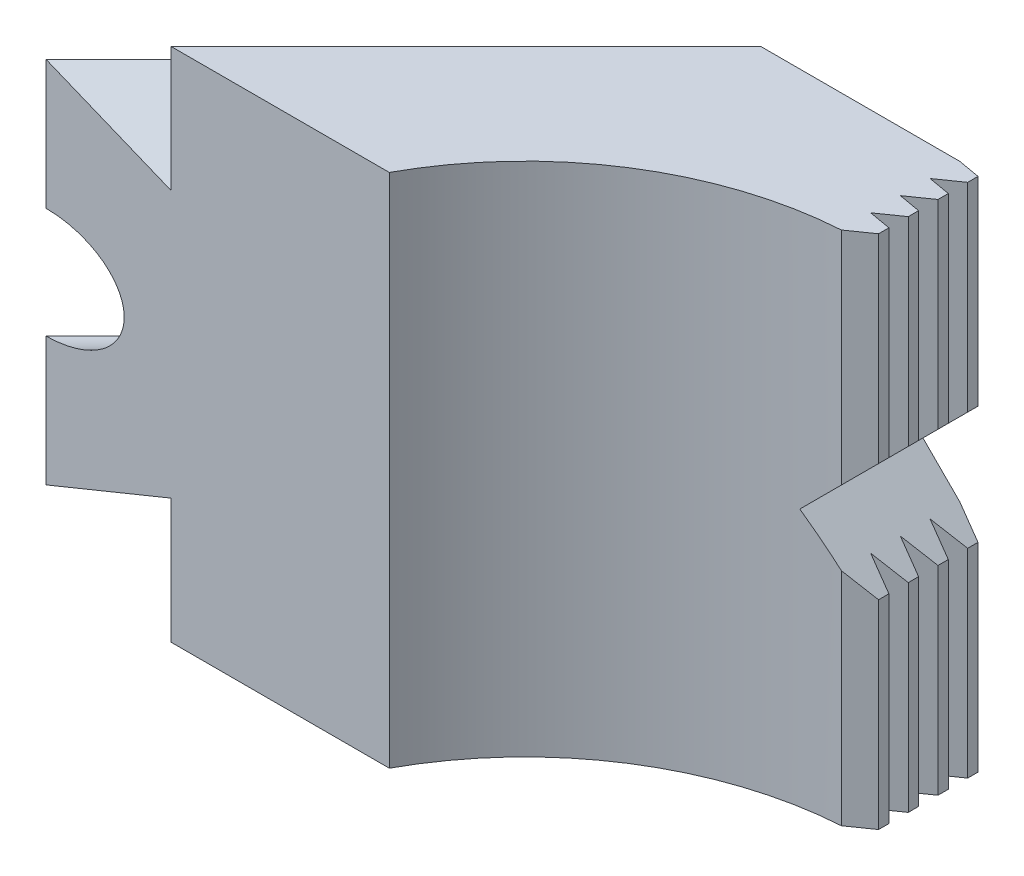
ISO-10303-21;
HEADER;
FILE_DESCRIPTION(('STEP AP214'),'2;1');
FILE_NAME('part.step','',(''),(''),'','','');
FILE_SCHEMA(('AUTOMOTIVE_DESIGN { 1 0 10303 214 1 1 1 1 }'));
ENDSEC;
DATA;
#1=APPLICATION_CONTEXT('core data for automotive mechanical design processes');
#2=APPLICATION_PROTOCOL_DEFINITION('international standard','automotive_design',2000,#1);
#3=PRODUCT_CONTEXT('',#1,'mechanical');
#4=PRODUCT('Part','Part','',(#3));
#5=PRODUCT_RELATED_PRODUCT_CATEGORY('part','',(#4));
#6=PRODUCT_DEFINITION_FORMATION('','',#4);
#7=PRODUCT_DEFINITION_CONTEXT('part definition',#1,'design');
#8=PRODUCT_DEFINITION('design','',#6,#7);
#9=PRODUCT_DEFINITION_SHAPE('','',#8);
#10=(LENGTH_UNIT() NAMED_UNIT(*) SI_UNIT(.MILLI.,.METRE.));
#11=(NAMED_UNIT(*) PLANE_ANGLE_UNIT() SI_UNIT($,.RADIAN.));
#12=(NAMED_UNIT(*) SI_UNIT($,.STERADIAN.) SOLID_ANGLE_UNIT());
#13=UNCERTAINTY_MEASURE_WITH_UNIT(LENGTH_MEASURE(1.E-05),#10,'distance_accuracy_value','');
#14=(GEOMETRIC_REPRESENTATION_CONTEXT(3) GLOBAL_UNCERTAINTY_ASSIGNED_CONTEXT((#13)) GLOBAL_UNIT_ASSIGNED_CONTEXT((#10,
#11,#12)) REPRESENTATION_CONTEXT('',''));
#15=CARTESIAN_POINT('',(0.,0.,0.));
#16=DIRECTION('',(0.,0.,1.));
#17=DIRECTION('',(1.,0.,0.));
#18=AXIS2_PLACEMENT_3D('',#15,#16,#17);
#19=CARTESIAN_POINT('',(-7.34850685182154,0.630416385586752,12.1453964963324));
#20=DIRECTION('',(0.707106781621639,-4.35089394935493E-10,-0.707106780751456));
#21=DIRECTION('',(0.666666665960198,-0.33333333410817,0.666666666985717));
#22=AXIS2_PLACEMENT_3D('',#19,#20,#21);
#23=PLANE('',#22);
#24=DIRECTION('',(-0.459499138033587,0.7600796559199,-0.459499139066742));
#25=VECTOR('',#24,1.);
#26=CARTESIAN_POINT('',(-7.34850685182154,0.630416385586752,12.1453964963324));
#27=LINE('',#26,#25);
#28=CARTESIAN_POINT('',(-7.34850685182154,0.630416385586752,12.1453964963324));
#29=VERTEX_POINT('',#28);
#30=CARTESIAN_POINT('',(-8.93377887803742,3.2526911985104,10.5601244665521));
#31=VERTEX_POINT('',#30);
#32=EDGE_CURVE('E583',#29,#31,#27,.T.);
#33=ORIENTED_EDGE('',*,*,#32,.T.);
#34=DIRECTION('',(-0.695201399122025,-0.182729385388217,-0.695201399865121));
#35=VECTOR('',#34,1.);
#36=CARTESIAN_POINT('',(-8.93377887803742,3.2526911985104,10.5601244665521));
#37=LINE('',#36,#35);
#38=CARTESIAN_POINT('',(-11.3322237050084,2.62227481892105,8.16167963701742));
#39=VERTEX_POINT('',#38);
#40=EDGE_CURVE('E586',#31,#39,#37,.T.);
#41=ORIENTED_EDGE('',*,*,#40,.T.);
#42=DIRECTION('',(-0.235702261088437,-0.942809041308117,-0.235702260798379));
#43=VECTOR('',#42,1.);
#44=CARTESIAN_POINT('',(-11.3322237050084,2.62227481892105,8.16167963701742));
#45=LINE('',#44,#43);
#46=CARTESIAN_POINT('',(-12.1453965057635,-0.630416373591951,7.34850683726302));
#47=VERTEX_POINT('',#46);
#48=EDGE_CURVE('E589',#39,#47,#45,.T.);
#49=ORIENTED_EDGE('',*,*,#48,.T.);
#50=DIRECTION('',(0.459499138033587,-0.7600796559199,0.459499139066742));
#51=VECTOR('',#50,1.);
#52=CARTESIAN_POINT('',(-12.1453965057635,-0.630416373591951,7.34850683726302));
#53=LINE('',#52,#51);
#54=CARTESIAN_POINT('',(-10.5601244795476,-3.2526911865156,8.9337788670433));
#55=VERTEX_POINT('',#54);
#56=EDGE_CURVE('E592',#47,#55,#53,.T.);
#57=ORIENTED_EDGE('',*,*,#56,.T.);
#58=DIRECTION('',(0.695201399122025,0.182729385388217,0.695201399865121));
#59=VECTOR('',#58,1.);
#60=CARTESIAN_POINT('',(-10.5601244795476,-3.2526911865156,8.9337788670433));
#61=LINE('',#60,#59);
#62=CARTESIAN_POINT('',(-8.16167965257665,-2.62227480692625,11.332223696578));
#63=VERTEX_POINT('',#62);
#64=EDGE_CURVE('E595',#55,#63,#61,.T.);
#65=ORIENTED_EDGE('',*,*,#64,.T.);
#66=DIRECTION('',(0.235702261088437,0.942809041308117,0.235702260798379));
#67=VECTOR('',#66,1.);
#68=CARTESIAN_POINT('',(-8.16167965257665,-2.62227480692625,11.332223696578));
#69=LINE('',#68,#67);
#70=EDGE_CURVE('E598',#63,#29,#69,.T.);
#71=ORIENTED_EDGE('',*,*,#70,.T.);
#72=EDGE_LOOP('',(#33,#41,#49,#57,#65,#71));
#73=FACE_BOUND('',#72,.T.);
#74=ADVANCED_FACE('F14',(#73),#23,.F.);
#75=CARTESIAN_POINT('',(-8.93377887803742,3.2526911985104,10.5601244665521));
#76=DIRECTION('',(-0.12920918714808,0.983163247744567,-0.129209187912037));
#77=DIRECTION('',(-0.695201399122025,-0.182729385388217,-0.695201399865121));
#78=AXIS2_PLACEMENT_3D('',#75,#76,#77);
#79=PLANE('',#78);
#80=DIRECTION('',(-0.695201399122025,-0.182729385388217,-0.695201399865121));
#81=VECTOR('',#80,1.);
#82=CARTESIAN_POINT('',(-13.1764195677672,3.25269120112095,14.8027651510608));
#83=LINE('',#82,#81);
#84=CARTESIAN_POINT('',(-13.1764195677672,3.25269120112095,14.8027651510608));
#85=VERTEX_POINT('',#84);
#86=CARTESIAN_POINT('',(-15.5748643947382,2.6222748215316,12.4043203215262));
#87=VERTEX_POINT('',#86);
#88=EDGE_CURVE('E568',#85,#87,#83,.T.);
#89=ORIENTED_EDGE('',*,*,#88,.T.);
#90=DIRECTION('',(-0.707106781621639,4.35089394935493E-10,0.707106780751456));
#91=VECTOR('',#90,1.);
#92=CARTESIAN_POINT('',(-11.3322237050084,2.62227481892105,8.16167963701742));
#93=LINE('',#92,#91);
#94=EDGE_CURVE('E611',#39,#87,#93,.T.);
#95=ORIENTED_EDGE('',*,*,#94,.F.);
#96=ORIENTED_EDGE('',*,*,#40,.F.);
#97=DIRECTION('',(-0.707106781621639,4.35089394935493E-10,0.707106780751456));
#98=VECTOR('',#97,1.);
#99=CARTESIAN_POINT('',(-8.93377887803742,3.2526911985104,10.5601244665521));
#100=LINE('',#99,#98);
#101=EDGE_CURVE('E601',#31,#85,#100,.T.);
#102=ORIENTED_EDGE('',*,*,#101,.T.);
#103=EDGE_LOOP('',(#89,#95,#96,#102));
#104=FACE_BOUND('',#103,.T.);
#105=ADVANCED_FACE('F640',(#104),#79,.F.);
#106=CARTESIAN_POINT('',(-11.3322237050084,2.62227481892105,8.16167963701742));
#107=DIRECTION('',(-0.666666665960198,0.33333333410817,-0.666666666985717));
#108=DIRECTION('',(-0.235702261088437,-0.942809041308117,-0.235702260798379));
#109=AXIS2_PLACEMENT_3D('',#106,#107,#108);
#110=PLANE('',#109);
#111=DIRECTION('',(-0.235702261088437,-0.942809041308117,-0.235702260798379));
#112=VECTOR('',#111,1.);
#113=CARTESIAN_POINT('',(-15.5748643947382,2.6222748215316,12.4043203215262));
#114=LINE('',#113,#112);
#115=CARTESIAN_POINT('',(-16.3880371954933,-0.6304163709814,11.5911475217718));
#116=VERTEX_POINT('',#115);
#117=EDGE_CURVE('E571',#87,#116,#114,.T.);
#118=ORIENTED_EDGE('',*,*,#117,.T.);
#119=DIRECTION('',(-0.707106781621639,4.35089394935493E-10,0.707106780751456));
#120=VECTOR('',#119,1.);
#121=CARTESIAN_POINT('',(-12.1453965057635,-0.630416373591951,7.34850683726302));
#122=LINE('',#121,#120);
#123=EDGE_CURVE('E609',#47,#116,#122,.T.);
#124=ORIENTED_EDGE('',*,*,#123,.F.);
#125=ORIENTED_EDGE('',*,*,#48,.F.);
#126=ORIENTED_EDGE('',*,*,#94,.T.);
#127=EDGE_LOOP('',(#118,#124,#125,#126));
#128=FACE_BOUND('',#127,.T.);
#129=ADVANCED_FACE('F647',(#128),#110,.F.);
#130=CARTESIAN_POINT('',(-12.1453965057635,-0.630416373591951,7.34850683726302));
#131=DIRECTION('',(-0.537457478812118,-0.649829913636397,-0.53745747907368));
#132=DIRECTION('',(0.459499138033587,-0.7600796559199,0.459499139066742));
#133=AXIS2_PLACEMENT_3D('',#130,#131,#132);
#134=PLANE('',#133);
#135=DIRECTION('',(0.459499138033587,-0.7600796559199,0.459499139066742));
#136=VECTOR('',#135,1.);
#137=CARTESIAN_POINT('',(-16.3880371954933,-0.6304163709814,11.5911475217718));
#138=LINE('',#137,#136);
#139=CARTESIAN_POINT('',(-14.8027651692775,-3.25269118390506,13.176419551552));
#140=VERTEX_POINT('',#139);
#141=EDGE_CURVE('E574',#116,#140,#138,.T.);
#142=ORIENTED_EDGE('',*,*,#141,.T.);
#143=DIRECTION('',(-0.707106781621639,4.35089394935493E-10,0.707106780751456));
#144=VECTOR('',#143,1.);
#145=CARTESIAN_POINT('',(-10.5601244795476,-3.2526911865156,8.9337788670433));
#146=LINE('',#145,#144);
#147=EDGE_CURVE('E607',#55,#140,#146,.T.);
#148=ORIENTED_EDGE('',*,*,#147,.F.);
#149=ORIENTED_EDGE('',*,*,#56,.F.);
#150=ORIENTED_EDGE('',*,*,#123,.T.);
#151=EDGE_LOOP('',(#142,#148,#149,#150));
#152=FACE_BOUND('',#151,.T.);
#153=ADVANCED_FACE('F660',(#152),#134,.F.);
#154=CARTESIAN_POINT('',(-10.5601244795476,-3.2526911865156,8.9337788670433));
#155=DIRECTION('',(0.12920918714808,-0.983163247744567,0.129209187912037));
#156=DIRECTION('',(0.695201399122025,0.182729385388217,0.695201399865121));
#157=AXIS2_PLACEMENT_3D('',#154,#155,#156);
#158=PLANE('',#157);
#159=DIRECTION('',(0.695201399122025,0.182729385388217,0.695201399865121));
#160=VECTOR('',#159,1.);
#161=CARTESIAN_POINT('',(-14.8027651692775,-3.25269118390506,13.176419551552));
#162=LINE('',#161,#160);
#163=CARTESIAN_POINT('',(-12.4043203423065,-2.6222748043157,15.5748643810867));
#164=VERTEX_POINT('',#163);
#165=EDGE_CURVE('E577',#140,#164,#162,.T.);
#166=ORIENTED_EDGE('',*,*,#165,.T.);
#167=DIRECTION('',(-0.707106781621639,4.35089394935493E-10,0.707106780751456));
#168=VECTOR('',#167,1.);
#169=CARTESIAN_POINT('',(-8.16167965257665,-2.62227480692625,11.332223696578));
#170=LINE('',#169,#168);
#171=EDGE_CURVE('E605',#63,#164,#170,.T.);
#172=ORIENTED_EDGE('',*,*,#171,.F.);
#173=ORIENTED_EDGE('',*,*,#64,.F.);
#174=ORIENTED_EDGE('',*,*,#147,.T.);
#175=EDGE_LOOP('',(#166,#172,#173,#174));
#176=FACE_BOUND('',#175,.T.);
#177=ADVANCED_FACE('F656',(#176),#158,.F.);
#178=CARTESIAN_POINT('',(-8.16167965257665,-2.62227480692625,11.332223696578));
#179=DIRECTION('',(0.666666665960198,-0.33333333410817,0.666666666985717));
#180=DIRECTION('',(-0.707106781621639,4.35089394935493E-10,0.707106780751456));
#181=AXIS2_PLACEMENT_3D('',#178,#179,#180);
#182=PLANE('',#181);
#183=DIRECTION('',(0.235702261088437,0.942809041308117,0.235702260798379));
#184=VECTOR('',#183,1.);
#185=CARTESIAN_POINT('',(-12.4043203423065,-2.6222748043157,15.5748643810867));
#186=LINE('',#185,#184);
#187=CARTESIAN_POINT('',(-11.5911475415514,0.630416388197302,16.3880371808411));
#188=VERTEX_POINT('',#187);
#189=EDGE_CURVE('E580',#164,#188,#186,.T.);
#190=ORIENTED_EDGE('',*,*,#189,.T.);
#191=DIRECTION('',(-0.707106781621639,4.35089394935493E-10,0.707106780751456));
#192=VECTOR('',#191,1.);
#193=CARTESIAN_POINT('',(-7.34850685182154,0.630416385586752,12.1453964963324));
#194=LINE('',#193,#192);
#195=EDGE_CURVE('E602',#29,#188,#194,.T.);
#196=ORIENTED_EDGE('',*,*,#195,.F.);
#197=ORIENTED_EDGE('',*,*,#70,.F.);
#198=ORIENTED_EDGE('',*,*,#171,.T.);
#199=EDGE_LOOP('',(#190,#196,#197,#198));
#200=FACE_BOUND('',#199,.T.);
#201=ADVANCED_FACE('F636',(#200),#182,.F.);
#202=CARTESIAN_POINT('',(-7.34850685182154,0.630416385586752,12.1453964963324));
#203=DIRECTION('',(0.537457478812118,0.649829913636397,0.53745747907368));
#204=DIRECTION('',(-0.459499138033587,0.7600796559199,-0.459499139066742));
#205=AXIS2_PLACEMENT_3D('',#202,#203,#204);
#206=PLANE('',#205);
#207=DIRECTION('',(-0.459499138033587,0.7600796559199,-0.459499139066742));
#208=VECTOR('',#207,1.);
#209=CARTESIAN_POINT('',(-11.5911475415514,0.630416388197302,16.3880371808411));
#210=LINE('',#209,#208);
#211=EDGE_CURVE('E566',#188,#85,#210,.T.);
#212=ORIENTED_EDGE('',*,*,#211,.T.);
#213=ORIENTED_EDGE('',*,*,#101,.F.);
#214=ORIENTED_EDGE('',*,*,#32,.F.);
#215=ORIENTED_EDGE('',*,*,#195,.T.);
#216=EDGE_LOOP('',(#212,#213,#214,#215));
#217=FACE_BOUND('',#216,.T.);
#218=ADVANCED_FACE('F628',(#217),#206,.F.);
#219=CARTESIAN_POINT('',(-4.0900974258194,2.51670212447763E-09,4.09009742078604));
#220=DIRECTION('',(-0.707106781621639,4.35089394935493E-10,0.707106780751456));
#221=DIRECTION('',(-0.666666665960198,0.33333333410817,-0.666666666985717));
#222=AXIS2_PLACEMENT_3D('',#219,#220,#221);
#223=PLANE('',#222);
#224=CARTESIAN_POINT('',(-4.0900974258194,2.51670212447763E-09,4.09009742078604));
#225=DIRECTION('',(-0.707106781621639,4.35089394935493E-10,0.707106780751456));
#226=DIRECTION('',(-0.666666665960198,0.33333333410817,-0.666666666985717));
#227=AXIS2_PLACEMENT_3D('',#224,#225,#226);
#228=CIRCLE('',#227,7.);
#229=CARTESIAN_POINT('',(-4.09009742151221,7.00000000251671,4.09009742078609));
#230=VERTEX_POINT('',#229);
#231=CARTESIAN_POINT('',(-4.09009743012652,-6.9999999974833,4.09009742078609));
#232=VERTEX_POINT('',#231);
#233=EDGE_CURVE('E604',#230,#232,#228,.T.);
#234=ORIENTED_EDGE('',*,*,#233,.F.);
#235=DIRECTION('',(-6.15309536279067E-10,-1.,0.));
#236=VECTOR('',#235,1.);
#237=CARTESIAN_POINT('',(-4.09009743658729,-17.4999999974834,4.09009742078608));
#238=LINE('',#237,#236);
#239=EDGE_CURVE('E548',#230,#232,#238,.T.);
#240=ORIENTED_EDGE('',*,*,#239,.T.);
#241=EDGE_LOOP('',(#234,#240));
#242=FACE_BOUND('',#241,.T.);
#243=ADVANCED_FACE('F626',(#242),#223,.F.);
#244=CARTESIAN_POINT('',(-13.9895923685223,8.60795115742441E-09,13.9895923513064));
#245=DIRECTION('',(-0.707106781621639,4.35089394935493E-10,0.707106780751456));
#246=DIRECTION('',(-0.666666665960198,0.33333333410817,-0.666666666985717));
#247=AXIS2_PLACEMENT_3D('',#244,#245,#246);
#248=PLANE('',#247);
#249=DIRECTION('',(-6.15309536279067E-10,-1.,0.));
#250=VECTOR('',#249,1.);
#251=CARTESIAN_POINT('',(-13.9895923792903,-17.4999999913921,13.9895923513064));
#252=LINE('',#251,#250);
#253=CARTESIAN_POINT('',(-13.9895923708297,-3.74999999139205,13.9895923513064));
#254=VERTEX_POINT('',#253);
#255=CARTESIAN_POINT('',(-13.9895923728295,-6.99999999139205,13.9895923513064));
#256=VERTEX_POINT('',#255);
#257=EDGE_CURVE('E31',#254,#256,#252,.T.);
#258=ORIENTED_EDGE('',*,*,#257,.F.);
#259=CARTESIAN_POINT('',(-13.9895923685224,8.60795115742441E-09,13.9895923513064));
#260=DIRECTION('',(-0.707106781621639,4.3508947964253E-10,0.707106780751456));
#261=DIRECTION('',(0.707106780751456,-4.35089533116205E-10,0.707106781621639));
#262=AXIS2_PLACEMENT_3D('',#259,#260,#261);
#263=CIRCLE('',#262,3.75);
#264=CARTESIAN_POINT('',(-13.989592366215,3.75000000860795,13.9895923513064));
#265=VERTEX_POINT('',#264);
#266=EDGE_CURVE('E522',#254,#265,#263,.T.);
#267=ORIENTED_EDGE('',*,*,#266,.T.);
#268=CARTESIAN_POINT('',(-13.9895923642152,7.00000000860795,13.9895923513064));
#269=VERTEX_POINT('',#268);
#270=EDGE_CURVE('E39',#269,#265,#252,.T.);
#271=ORIENTED_EDGE('',*,*,#270,.F.);
#272=CARTESIAN_POINT('',(-13.9895923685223,8.60795115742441E-09,13.9895923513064));
#273=DIRECTION('',(-0.707106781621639,4.35089394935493E-10,0.707106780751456));
#274=DIRECTION('',(-0.666666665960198,0.33333333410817,-0.666666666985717));
#275=AXIS2_PLACEMENT_3D('',#272,#273,#274);
#276=CIRCLE('',#275,7.);
#277=EDGE_CURVE('E18',#269,#256,#276,.T.);
#278=ORIENTED_EDGE('',*,*,#277,.T.);
#279=EDGE_LOOP('',(#258,#267,#271,#278));
#280=FACE_BOUND('',#279,.T.);
#281=ORIENTED_EDGE('',*,*,#211,.F.);
#282=ORIENTED_EDGE('',*,*,#189,.F.);
#283=ORIENTED_EDGE('',*,*,#165,.F.);
#284=ORIENTED_EDGE('',*,*,#141,.F.);
#285=ORIENTED_EDGE('',*,*,#117,.F.);
#286=ORIENTED_EDGE('',*,*,#88,.F.);
#287=EDGE_LOOP('',(#281,#282,#283,#284,#285,#286));
#288=FACE_BOUND('',#287,.T.);
#289=ADVANCED_FACE('F619',(#280,#288),#248,.T.);
#290=CARTESIAN_POINT('',(-13.9895923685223,8.60795115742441E-09,13.9895923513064));
#291=DIRECTION('',(0.707106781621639,-4.35089394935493E-10,-0.707106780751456));
#292=DIRECTION('',(0.666666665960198,-0.33333333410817,0.666666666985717));
#293=AXIS2_PLACEMENT_3D('',#290,#291,#292);
#294=CYLINDRICAL_SURFACE('',#293,7.);
#295=DIRECTION('',(-0.707106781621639,4.3508947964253E-10,0.707106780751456));
#296=VECTOR('',#295,1.);
#297=CARTESIAN_POINT('',(-4.09009743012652,-6.9999999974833,4.09009742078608));
#298=LINE('',#297,#296);
#299=EDGE_CURVE('E9',#256,#232,#298,.F.);
#300=ORIENTED_EDGE('',*,*,#299,.F.);
#301=ORIENTED_EDGE('',*,*,#277,.F.);
#302=DIRECTION('',(-0.707106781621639,4.3508947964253E-10,0.707106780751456));
#303=VECTOR('',#302,1.);
#304=CARTESIAN_POINT('',(-4.09009742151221,7.00000000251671,4.09009742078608));
#305=LINE('',#304,#303);
#306=EDGE_CURVE('E23',#230,#269,#305,.T.);
#307=ORIENTED_EDGE('',*,*,#306,.F.);
#308=ORIENTED_EDGE('',*,*,#233,.T.);
#309=EDGE_LOOP('',(#300,#301,#307,#308));
#310=FACE_BOUND('',#309,.T.);
#311=ADVANCED_FACE('F16',(#310),#294,.T.);
#312=CARTESIAN_POINT('',(23.4852813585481,-17.5000000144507,8.00000001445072));
#313=DIRECTION('',(-1.,6.15309435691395E-10,-6.15309534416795E-10));
#314=DIRECTION('',(-6.15309617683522E-10,0.,1.));
#315=AXIS2_PLACEMENT_3D('',#312,#313,#314);
#316=PLANE('',#315);
#317=DIRECTION('',(6.15309491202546E-10,1.,0.));
#318=VECTOR('',#317,1.);
#319=CARTESIAN_POINT('',(23.4852813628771,-17.5000000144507,0.964490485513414));
#320=LINE('',#319,#318);
#321=CARTESIAN_POINT('',(23.4852813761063,3.99999998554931,0.96449048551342));
#322=VERTEX_POINT('',#321);
#323=CARTESIAN_POINT('',(23.485281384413,17.4999999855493,0.964490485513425));
#324=VERTEX_POINT('',#323);
#325=EDGE_CURVE('E424',#322,#324,#320,.T.);
#326=ORIENTED_EDGE('',*,*,#325,.F.);
#327=DIRECTION('',(6.15310362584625E-10,0.,-1.));
#328=VECTOR('',#327,1.);
#329=CARTESIAN_POINT('',(23.4852813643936,3.99999998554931,20.0000000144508));
#330=LINE('',#329,#328);
#331=CARTESIAN_POINT('',(23.4852813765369,3.99999998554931,0.264490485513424));
#332=VERTEX_POINT('',#331);
#333=EDGE_CURVE('E306',#322,#332,#330,.T.);
#334=ORIENTED_EDGE('',*,*,#333,.T.);
#335=DIRECTION('',(6.15309491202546E-10,1.,0.));
#336=VECTOR('',#335,1.);
#337=CARTESIAN_POINT('',(23.4852813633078,-17.5000000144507,0.264490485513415));
#338=LINE('',#337,#336);
#339=CARTESIAN_POINT('',(23.4852813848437,17.4999999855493,0.264490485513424));
#340=VERTEX_POINT('',#339);
#341=EDGE_CURVE('E429',#332,#340,#338,.T.);
#342=ORIENTED_EDGE('',*,*,#341,.T.);
#343=DIRECTION('',(-6.15309617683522E-10,0.,1.));
#344=VECTOR('',#343,1.);
#345=CARTESIAN_POINT('',(23.485281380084,17.4999999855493,8.00000001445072));
#346=LINE('',#345,#344);
#347=EDGE_CURVE('E480',#340,#324,#346,.T.);
#348=ORIENTED_EDGE('',*,*,#347,.T.);
#349=EDGE_LOOP('',(#326,#334,#342,#348));
#350=FACE_BOUND('',#349,.T.);
#351=ADVANCED_FACE('F740',(#350),#316,.F.);
#352=CARTESIAN_POINT('',(23.4852813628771,-17.5000000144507,0.964490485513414));
#353=DIRECTION('',(-0.573576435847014,3.52927061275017E-10,-0.819152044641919));
#354=DIRECTION('',(-0.819152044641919,5.04031934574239E-10,0.573576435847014));
#355=AXIS2_PLACEMENT_3D('',#352,#353,#354);
#356=PLANE('',#355);
#357=DIRECTION('',(6.15309491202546E-10,1.,0.));
#358=VECTOR('',#357,1.);
#359=CARTESIAN_POINT('',(21.9852813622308,-17.5000000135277,2.01480179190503));
#360=LINE('',#359,#358);
#361=CARTESIAN_POINT('',(21.985281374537,2.49999998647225,2.01480179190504));
#362=VERTEX_POINT('',#361);
#363=CARTESIAN_POINT('',(21.9852813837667,17.4999999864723,2.01480179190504));
#364=VERTEX_POINT('',#363);
#365=EDGE_CURVE('E471',#362,#364,#360,.T.);
#366=ORIENTED_EDGE('',*,*,#365,.F.);
#367=DIRECTION('',(0.633687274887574,0.633687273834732,-0.443712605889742));
#368=VECTOR('',#367,1.);
#369=CARTESIAN_POINT('',(14.8517507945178,-4.633530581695,7.0097536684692));
#370=LINE('',#369,#368);
#371=EDGE_CURVE('E373',#362,#322,#370,.T.);
#372=ORIENTED_EDGE('',*,*,#371,.T.);
#373=ORIENTED_EDGE('',*,*,#325,.T.);
#374=DIRECTION('',(-0.819152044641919,5.04031934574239E-10,0.573576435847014));
#375=VECTOR('',#374,1.);
#376=CARTESIAN_POINT('',(23.485281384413,17.4999999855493,0.964490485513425));
#377=LINE('',#376,#375);
#378=EDGE_CURVE('E376',#324,#364,#377,.T.);
#379=ORIENTED_EDGE('',*,*,#378,.T.);
#380=EDGE_LOOP('',(#366,#372,#373,#379));
#381=FACE_BOUND('',#380,.T.);
#382=ADVANCED_FACE('F747',(#381),#356,.F.);
#383=CARTESIAN_POINT('',(21.9852813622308,-17.5000000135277,2.01480179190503));
#384=DIRECTION('',(-0.17364817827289,1.06847280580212E-10,0.984807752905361));
#385=DIRECTION('',(0.984807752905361,-6.05961517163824E-10,0.173648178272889));
#386=AXIS2_PLACEMENT_3D('',#383,#384,#385);
#387=PLANE('',#386);
#388=DIRECTION('',(6.15309491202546E-10,1.,0.));
#389=VECTOR('',#388,1.);
#390=CARTESIAN_POINT('',(23.4852813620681,-17.5000000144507,2.27929226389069));
#391=LINE('',#390,#389);
#392=CARTESIAN_POINT('',(23.4852813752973,3.99999998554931,2.2792922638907));
#393=VERTEX_POINT('',#392);
#394=CARTESIAN_POINT('',(23.485281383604,17.4999999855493,2.2792922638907));
#395=VERTEX_POINT('',#394);
#396=EDGE_CURVE('E467',#393,#395,#391,.T.);
#397=ORIENTED_EDGE('',*,*,#396,.F.);
#398=DIRECTION('',(-0.701673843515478,-0.701673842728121,-0.123724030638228));
#399=VECTOR('',#398,1.);
#400=CARTESIAN_POINT('',(12.1383577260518,-7.34692365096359,0.278523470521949));
#401=LINE('',#400,#399);
#402=EDGE_CURVE('E370',#393,#362,#401,.T.);
#403=ORIENTED_EDGE('',*,*,#402,.T.);
#404=ORIENTED_EDGE('',*,*,#365,.T.);
#405=DIRECTION('',(0.984807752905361,-6.05961517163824E-10,0.173648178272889));
#406=VECTOR('',#405,1.);
#407=CARTESIAN_POINT('',(21.9852813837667,17.4999999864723,2.01480179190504));
#408=LINE('',#407,#406);
#409=EDGE_CURVE('E379',#364,#395,#408,.T.);
#410=ORIENTED_EDGE('',*,*,#409,.T.);
#411=EDGE_LOOP('',(#397,#403,#404,#410));
#412=FACE_BOUND('',#411,.T.);
#413=ADVANCED_FACE('F758',(#412),#387,.F.);
#414=DIRECTION('',(6.15309491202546E-10,1.,0.));
#415=VECTOR('',#414,1.);
#416=CARTESIAN_POINT('',(23.4852813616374,-17.5000000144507,2.97929226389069));
#417=LINE('',#416,#415);
#418=CARTESIAN_POINT('',(23.4852813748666,3.99999998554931,2.9792922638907));
#419=VERTEX_POINT('',#418);
#420=CARTESIAN_POINT('',(23.4852813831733,17.4999999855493,2.9792922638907));
#421=VERTEX_POINT('',#420);
#422=EDGE_CURVE('E463',#419,#421,#417,.T.);
#423=ORIENTED_EDGE('',*,*,#422,.F.);
#424=EDGE_CURVE('E328',#419,#393,#330,.T.);
#425=ORIENTED_EDGE('',*,*,#424,.T.);
#426=ORIENTED_EDGE('',*,*,#396,.T.);
#427=EDGE_CURVE('E1112',#395,#421,#346,.T.);
#428=ORIENTED_EDGE('',*,*,#427,.T.);
#429=EDGE_LOOP('',(#423,#425,#426,#428));
#430=FACE_BOUND('',#429,.T.);
#431=ADVANCED_FACE('F751',(#430),#316,.F.);
#432=CARTESIAN_POINT('',(23.4852813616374,-17.5000000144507,2.97929226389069));
#433=DIRECTION('',(-0.573576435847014,3.52927061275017E-10,-0.819152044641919));
#434=DIRECTION('',(-0.819152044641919,5.04031934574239E-10,0.573576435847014));
#435=AXIS2_PLACEMENT_3D('',#432,#433,#434);
#436=PLANE('',#435);
#437=DIRECTION('',(6.15309491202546E-10,1.,0.));
#438=VECTOR('',#437,1.);
#439=CARTESIAN_POINT('',(21.9852813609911,-17.5000000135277,4.0296035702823));
#440=LINE('',#439,#438);
#441=CARTESIAN_POINT('',(21.9852813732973,2.49999998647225,4.02960357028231));
#442=VERTEX_POINT('',#441);
#443=CARTESIAN_POINT('',(21.9852813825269,17.4999999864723,4.02960357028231));
#444=VERTEX_POINT('',#443);
#445=EDGE_CURVE('E459',#442,#444,#440,.T.);
#446=ORIENTED_EDGE('',*,*,#445,.F.);
#447=DIRECTION('',(0.633687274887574,0.633687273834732,-0.443712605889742));
#448=VECTOR('',#447,1.);
#449=CARTESIAN_POINT('',(14.851750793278,-4.633530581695,9.02455544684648));
#450=LINE('',#449,#448);
#451=EDGE_CURVE('E367',#442,#419,#450,.T.);
#452=ORIENTED_EDGE('',*,*,#451,.T.);
#453=ORIENTED_EDGE('',*,*,#422,.T.);
#454=DIRECTION('',(-0.819152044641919,5.04031934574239E-10,0.573576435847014));
#455=VECTOR('',#454,1.);
#456=CARTESIAN_POINT('',(23.4852813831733,17.4999999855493,2.9792922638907));
#457=LINE('',#456,#455);
#458=EDGE_CURVE('E382',#421,#444,#457,.T.);
#459=ORIENTED_EDGE('',*,*,#458,.T.);
#460=EDGE_LOOP('',(#446,#452,#453,#459));
#461=FACE_BOUND('',#460,.T.);
#462=ADVANCED_FACE('F771',(#461),#436,.F.);
#463=CARTESIAN_POINT('',(21.9852813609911,-17.5000000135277,4.0296035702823));
#464=DIRECTION('',(-0.173648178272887,1.06847280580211E-10,0.984807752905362));
#465=DIRECTION('',(0.984807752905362,-6.05961517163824E-10,0.173648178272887));
#466=AXIS2_PLACEMENT_3D('',#463,#464,#465);
#467=PLANE('',#466);
#468=DIRECTION('',(6.15309491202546E-10,1.,0.));
#469=VECTOR('',#468,1.);
#470=CARTESIAN_POINT('',(23.4852813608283,-17.5000000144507,4.29409404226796));
#471=LINE('',#470,#469);
#472=CARTESIAN_POINT('',(23.4852813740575,3.99999998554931,4.29409404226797));
#473=VERTEX_POINT('',#472);
#474=CARTESIAN_POINT('',(23.4852813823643,17.4999999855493,4.29409404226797));
#475=VERTEX_POINT('',#474);
#476=EDGE_CURVE('E455',#473,#475,#471,.T.);
#477=ORIENTED_EDGE('',*,*,#476,.F.);
#478=DIRECTION('',(-0.701673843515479,-0.701673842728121,-0.123724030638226));
#479=VECTOR('',#478,1.);
#480=CARTESIAN_POINT('',(12.1383577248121,-7.34692365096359,2.29332524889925));
#481=LINE('',#480,#479);
#482=EDGE_CURVE('E364',#473,#442,#481,.T.);
#483=ORIENTED_EDGE('',*,*,#482,.T.);
#484=ORIENTED_EDGE('',*,*,#445,.T.);
#485=DIRECTION('',(0.984807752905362,-6.05961517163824E-10,0.173648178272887));
#486=VECTOR('',#485,1.);
#487=CARTESIAN_POINT('',(21.9852813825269,17.4999999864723,4.02960357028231));
#488=LINE('',#487,#486);
#489=EDGE_CURVE('E385',#444,#475,#488,.T.);
#490=ORIENTED_EDGE('',*,*,#489,.T.);
#491=EDGE_LOOP('',(#477,#483,#484,#490));
#492=FACE_BOUND('',#491,.T.);
#493=ADVANCED_FACE('F786',(#492),#467,.F.);
#494=DIRECTION('',(6.15309491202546E-10,1.,0.));
#495=VECTOR('',#494,1.);
#496=CARTESIAN_POINT('',(23.4852813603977,-17.5000000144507,4.99409404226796));
#497=LINE('',#496,#495);
#498=CARTESIAN_POINT('',(23.4852813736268,3.99999998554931,4.99409404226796));
#499=VERTEX_POINT('',#498);
#500=CARTESIAN_POINT('',(23.4852813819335,17.4999999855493,4.99409404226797));
#501=VERTEX_POINT('',#500);
#502=EDGE_CURVE('E451',#499,#501,#497,.T.);
#503=ORIENTED_EDGE('',*,*,#502,.F.);
#504=EDGE_CURVE('E1116',#499,#473,#330,.T.);
#505=ORIENTED_EDGE('',*,*,#504,.T.);
#506=ORIENTED_EDGE('',*,*,#476,.T.);
#507=EDGE_CURVE('E479',#475,#501,#346,.T.);
#508=ORIENTED_EDGE('',*,*,#507,.T.);
#509=EDGE_LOOP('',(#503,#505,#506,#508));
#510=FACE_BOUND('',#509,.T.);
#511=ADVANCED_FACE('F779',(#510),#316,.F.);
#512=CARTESIAN_POINT('',(23.4852813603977,-17.5000000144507,4.99409404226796));
#513=DIRECTION('',(-0.573576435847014,3.52927061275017E-10,-0.819152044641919));
#514=DIRECTION('',(-0.819152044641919,5.04031934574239E-10,0.573576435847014));
#515=AXIS2_PLACEMENT_3D('',#512,#513,#514);
#516=PLANE('',#515);
#517=DIRECTION('',(6.15309491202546E-10,1.,0.));
#518=VECTOR('',#517,1.);
#519=CARTESIAN_POINT('',(21.9852813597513,-17.5000000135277,6.04440534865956));
#520=LINE('',#519,#518);
#521=CARTESIAN_POINT('',(21.9852813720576,2.49999998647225,6.04440534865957));
#522=VERTEX_POINT('',#521);
#523=CARTESIAN_POINT('',(21.9852813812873,17.4999999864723,6.04440534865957));
#524=VERTEX_POINT('',#523);
#525=EDGE_CURVE('E447',#522,#524,#520,.T.);
#526=ORIENTED_EDGE('',*,*,#525,.F.);
#527=DIRECTION('',(0.633687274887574,0.633687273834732,-0.443712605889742));
#528=VECTOR('',#527,1.);
#529=CARTESIAN_POINT('',(14.8517507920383,-4.633530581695,11.0393572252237));
#530=LINE('',#529,#528);
#531=EDGE_CURVE('E361',#522,#499,#530,.T.);
#532=ORIENTED_EDGE('',*,*,#531,.T.);
#533=ORIENTED_EDGE('',*,*,#502,.T.);
#534=DIRECTION('',(-0.819152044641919,5.04031934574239E-10,0.573576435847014));
#535=VECTOR('',#534,1.);
#536=CARTESIAN_POINT('',(23.4852813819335,17.4999999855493,4.99409404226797));
#537=LINE('',#536,#535);
#538=EDGE_CURVE('E388',#501,#524,#537,.T.);
#539=ORIENTED_EDGE('',*,*,#538,.T.);
#540=EDGE_LOOP('',(#526,#532,#533,#539));
#541=FACE_BOUND('',#540,.T.);
#542=ADVANCED_FACE('F799',(#541),#516,.F.);
#543=CARTESIAN_POINT('',(21.9852813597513,-17.5000000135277,6.04440534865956));
#544=DIRECTION('',(-0.173648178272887,1.06847280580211E-10,0.984807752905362));
#545=DIRECTION('',(0.984807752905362,-6.05961517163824E-10,0.173648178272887));
#546=AXIS2_PLACEMENT_3D('',#543,#544,#545);
#547=PLANE('',#546);
#548=DIRECTION('',(6.15309491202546E-10,1.,0.));
#549=VECTOR('',#548,1.);
#550=CARTESIAN_POINT('',(23.4852813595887,-17.5000000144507,6.30889582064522));
#551=LINE('',#550,#549);
#552=CARTESIAN_POINT('',(23.4852813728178,3.99999998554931,6.30889582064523));
#553=VERTEX_POINT('',#552);
#554=CARTESIAN_POINT('',(23.4852813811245,17.4999999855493,6.30889582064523));
#555=VERTEX_POINT('',#554);
#556=EDGE_CURVE('E443',#553,#555,#551,.T.);
#557=ORIENTED_EDGE('',*,*,#556,.F.);
#558=DIRECTION('',(-0.701673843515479,-0.701673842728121,-0.123724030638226));
#559=VECTOR('',#558,1.);
#560=CARTESIAN_POINT('',(12.1383577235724,-7.34692365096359,4.30812702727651));
#561=LINE('',#560,#559);
#562=EDGE_CURVE('E358',#553,#522,#561,.T.);
#563=ORIENTED_EDGE('',*,*,#562,.T.);
#564=ORIENTED_EDGE('',*,*,#525,.T.);
#565=DIRECTION('',(0.984807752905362,-6.05961517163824E-10,0.173648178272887));
#566=VECTOR('',#565,1.);
#567=CARTESIAN_POINT('',(21.9852813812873,17.4999999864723,6.04440534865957));
#568=LINE('',#567,#566);
#569=EDGE_CURVE('E391',#524,#555,#568,.T.);
#570=ORIENTED_EDGE('',*,*,#569,.T.);
#571=EDGE_LOOP('',(#557,#563,#564,#570));
#572=FACE_BOUND('',#571,.T.);
#573=ADVANCED_FACE('F813',(#572),#547,.F.);
#574=DIRECTION('',(6.15309491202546E-10,1.,0.));
#575=VECTOR('',#574,1.);
#576=CARTESIAN_POINT('',(23.4852813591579,-17.5000000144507,7.00889582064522));
#577=LINE('',#576,#575);
#578=CARTESIAN_POINT('',(23.4852813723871,3.99999998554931,7.00889582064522));
#579=VERTEX_POINT('',#578);
#580=CARTESIAN_POINT('',(23.4852813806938,17.4999999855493,7.00889582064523));
#581=VERTEX_POINT('',#580);
#582=EDGE_CURVE('E439',#579,#581,#577,.T.);
#583=ORIENTED_EDGE('',*,*,#582,.F.);
#584=EDGE_CURVE('E329',#579,#553,#330,.T.);
#585=ORIENTED_EDGE('',*,*,#584,.T.);
#586=ORIENTED_EDGE('',*,*,#556,.T.);
#587=EDGE_CURVE('E476',#555,#581,#346,.T.);
#588=ORIENTED_EDGE('',*,*,#587,.T.);
#589=EDGE_LOOP('',(#583,#585,#586,#588));
#590=FACE_BOUND('',#589,.T.);
#591=ADVANCED_FACE('F741',(#590),#316,.F.);
#592=CARTESIAN_POINT('',(23.4852813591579,-17.5000000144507,7.00889582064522));
#593=DIRECTION('',(-0.573576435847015,3.52927061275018E-10,-0.819152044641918));
#594=DIRECTION('',(-0.819152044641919,5.04031934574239E-10,0.573576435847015));
#595=AXIS2_PLACEMENT_3D('',#592,#593,#594);
#596=PLANE('',#595);
#597=DIRECTION('',(6.15309491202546E-10,1.,0.));
#598=VECTOR('',#597,1.);
#599=CARTESIAN_POINT('',(22.0014052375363,-17.5000000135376,8.04791706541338));
#600=LINE('',#599,#598);
#601=CARTESIAN_POINT('',(22.0014052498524,2.51612386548,8.04791706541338));
#602=VERTEX_POINT('',#601);
#603=CARTESIAN_POINT('',(22.0014052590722,17.4999999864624,8.0479170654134));
#604=VERTEX_POINT('',#603);
#605=EDGE_CURVE('E435',#602,#604,#600,.T.);
#606=ORIENTED_EDGE('',*,*,#605,.F.);
#607=DIRECTION('',(0.633687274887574,0.633687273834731,-0.443712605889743));
#608=VECTOR('',#607,1.);
#609=CARTESIAN_POINT('',(14.8517507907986,-4.633530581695,13.054159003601));
#610=LINE('',#609,#608);
#611=EDGE_CURVE('E354',#602,#579,#610,.T.);
#612=ORIENTED_EDGE('',*,*,#611,.T.);
#613=ORIENTED_EDGE('',*,*,#582,.T.);
#614=DIRECTION('',(-0.819152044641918,5.04031934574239E-10,0.573576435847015));
#615=VECTOR('',#614,1.);
#616=CARTESIAN_POINT('',(23.4852813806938,17.4999999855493,7.00889582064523));
#617=LINE('',#616,#615);
#618=EDGE_CURVE('E394',#581,#604,#617,.T.);
#619=ORIENTED_EDGE('',*,*,#618,.T.);
#620=EDGE_LOOP('',(#606,#612,#613,#619));
#621=FACE_BOUND('',#620,.T.);
#622=ADVANCED_FACE('F826',(#621),#596,.F.);
#623=CARTESIAN_POINT('',(23.4852813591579,-17.5000000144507,7.00889582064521));
#624=VERTEX_POINT('',#623);
#625=CARTESIAN_POINT('',(23.4852813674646,-4.0000000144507,7.00889582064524));
#626=VERTEX_POINT('',#625);
#627=EDGE_CURVE('E436',#624,#626,#577,.T.);
#628=ORIENTED_EDGE('',*,*,#627,.T.);
#629=DIRECTION('',(-0.633687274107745,0.633687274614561,0.443712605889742));
#630=VECTOR('',#629,1.);
#631=CARTESIAN_POINT('',(28.9063354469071,-9.4210540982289,3.21303289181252));
#632=LINE('',#631,#630);
#633=CARTESIAN_POINT('',(22.0014052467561,-2.51612389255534,8.04791706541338));
#634=VERTEX_POINT('',#633);
#635=EDGE_CURVE('E331',#626,#634,#632,.T.);
#636=ORIENTED_EDGE('',*,*,#635,.T.);
#637=CARTESIAN_POINT('',(22.0014052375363,-17.5000000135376,8.04791706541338));
#638=VERTEX_POINT('',#637);
#639=EDGE_CURVE('E432',#638,#634,#600,.T.);
#640=ORIENTED_EDGE('',*,*,#639,.F.);
#641=DIRECTION('',(-0.819152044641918,5.04031934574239E-10,0.573576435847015));
#642=VECTOR('',#641,1.);
#643=CARTESIAN_POINT('',(23.4852813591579,-17.5000000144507,7.00889582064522));
#644=LINE('',#643,#642);
#645=EDGE_CURVE('E418',#624,#638,#644,.T.);
#646=ORIENTED_EDGE('',*,*,#645,.F.);
#647=EDGE_LOOP('',(#628,#636,#640,#646));
#648=FACE_BOUND('',#647,.T.);
#649=ADVANCED_FACE('F841',(#648),#596,.F.);
#650=CARTESIAN_POINT('',(23.4852813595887,-17.5000000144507,6.30889582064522));
#651=VERTEX_POINT('',#650);
#652=CARTESIAN_POINT('',(23.4852813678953,-4.0000000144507,6.30889582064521));
#653=VERTEX_POINT('',#652);
#654=EDGE_CURVE('E440',#651,#653,#551,.T.);
#655=ORIENTED_EDGE('',*,*,#654,.T.);
#656=DIRECTION('',(6.15310362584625E-10,0.,-1.));
#657=VECTOR('',#656,1.);
#658=CARTESIAN_POINT('',(23.485281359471,-4.0000000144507,20.0000000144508));
#659=LINE('',#658,#657);
#660=EDGE_CURVE('E307',#626,#653,#659,.T.);
#661=ORIENTED_EDGE('',*,*,#660,.F.);
#662=ORIENTED_EDGE('',*,*,#627,.F.);
#663=DIRECTION('',(-6.15309617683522E-10,0.,1.));
#664=VECTOR('',#663,1.);
#665=CARTESIAN_POINT('',(23.4852813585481,-17.5000000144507,8.00000001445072));
#666=LINE('',#665,#664);
#667=EDGE_CURVE('E483',#651,#624,#666,.T.);
#668=ORIENTED_EDGE('',*,*,#667,.F.);
#669=EDGE_LOOP('',(#655,#661,#662,#668));
#670=FACE_BOUND('',#669,.T.);
#671=ADVANCED_FACE('F750',(#670),#316,.F.);
#672=CARTESIAN_POINT('',(21.9852813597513,-17.5000000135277,6.04440534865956));
#673=VERTEX_POINT('',#672);
#674=CARTESIAN_POINT('',(21.985281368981,-2.50000001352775,6.04440534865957));
#675=VERTEX_POINT('',#674);
#676=EDGE_CURVE('E444',#673,#675,#520,.T.);
#677=ORIENTED_EDGE('',*,*,#676,.T.);
#678=DIRECTION('',(0.701673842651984,-0.701673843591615,0.123724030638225));
#679=VECTOR('',#678,1.);
#680=CARTESIAN_POINT('',(29.3704740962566,-9.885192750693,7.34661408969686));
#681=LINE('',#680,#679);
#682=EDGE_CURVE('E336',#675,#653,#681,.T.);
#683=ORIENTED_EDGE('',*,*,#682,.T.);
#684=ORIENTED_EDGE('',*,*,#654,.F.);
#685=DIRECTION('',(0.984807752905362,-6.05961517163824E-10,0.173648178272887));
#686=VECTOR('',#685,1.);
#687=CARTESIAN_POINT('',(21.9852813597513,-17.5000000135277,6.04440534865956));
#688=LINE('',#687,#686);
#689=EDGE_CURVE('E415',#673,#651,#688,.T.);
#690=ORIENTED_EDGE('',*,*,#689,.F.);
#691=EDGE_LOOP('',(#677,#683,#684,#690));
#692=FACE_BOUND('',#691,.T.);
#693=ADVANCED_FACE('F825',(#692),#547,.F.);
#694=CARTESIAN_POINT('',(23.4852813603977,-17.5000000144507,4.99409404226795));
#695=VERTEX_POINT('',#694);
#696=CARTESIAN_POINT('',(23.4852813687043,-4.0000000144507,4.99409404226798));
#697=VERTEX_POINT('',#696);
#698=EDGE_CURVE('E448',#695,#697,#497,.T.);
#699=ORIENTED_EDGE('',*,*,#698,.T.);
#700=DIRECTION('',(-0.633687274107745,0.633687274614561,0.443712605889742));
#701=VECTOR('',#700,1.);
#702=CARTESIAN_POINT('',(28.9063354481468,-9.4210540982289,1.19823111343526));
#703=LINE('',#702,#701);
#704=EDGE_CURVE('E339',#697,#675,#703,.T.);
#705=ORIENTED_EDGE('',*,*,#704,.T.);
#706=ORIENTED_EDGE('',*,*,#676,.F.);
#707=DIRECTION('',(-0.819152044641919,5.04031934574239E-10,0.573576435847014));
#708=VECTOR('',#707,1.);
#709=CARTESIAN_POINT('',(23.4852813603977,-17.5000000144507,4.99409404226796));
#710=LINE('',#709,#708);
#711=EDGE_CURVE('E412',#695,#673,#710,.T.);
#712=ORIENTED_EDGE('',*,*,#711,.F.);
#713=EDGE_LOOP('',(#699,#705,#706,#712));
#714=FACE_BOUND('',#713,.T.);
#715=ADVANCED_FACE('F816',(#714),#516,.F.);
#716=CARTESIAN_POINT('',(23.4852813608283,-17.5000000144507,4.29409404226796));
#717=VERTEX_POINT('',#716);
#718=CARTESIAN_POINT('',(23.485281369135,-4.0000000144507,4.29409404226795));
#719=VERTEX_POINT('',#718);
#720=EDGE_CURVE('E452',#717,#719,#471,.T.);
#721=ORIENTED_EDGE('',*,*,#720,.T.);
#722=EDGE_CURVE('E1136',#697,#719,#659,.T.);
#723=ORIENTED_EDGE('',*,*,#722,.F.);
#724=ORIENTED_EDGE('',*,*,#698,.F.);
#725=EDGE_CURVE('E486',#717,#695,#666,.T.);
#726=ORIENTED_EDGE('',*,*,#725,.F.);
#727=EDGE_LOOP('',(#721,#723,#724,#726));
#728=FACE_BOUND('',#727,.T.);
#729=ADVANCED_FACE('F860',(#728),#316,.F.);
#730=CARTESIAN_POINT('',(21.9852813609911,-17.5000000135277,4.0296035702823));
#731=VERTEX_POINT('',#730);
#732=CARTESIAN_POINT('',(21.9852813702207,-2.50000001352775,4.02960357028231));
#733=VERTEX_POINT('',#732);
#734=EDGE_CURVE('E456',#731,#733,#440,.T.);
#735=ORIENTED_EDGE('',*,*,#734,.T.);
#736=DIRECTION('',(0.701673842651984,-0.701673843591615,0.123724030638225));
#737=VECTOR('',#736,1.);
#738=CARTESIAN_POINT('',(29.3704740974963,-9.885192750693,5.3318123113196));
#739=LINE('',#738,#737);
#740=EDGE_CURVE('E342',#733,#719,#739,.T.);
#741=ORIENTED_EDGE('',*,*,#740,.T.);
#742=ORIENTED_EDGE('',*,*,#720,.F.);
#743=DIRECTION('',(0.984807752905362,-6.05961517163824E-10,0.173648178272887));
#744=VECTOR('',#743,1.);
#745=CARTESIAN_POINT('',(21.9852813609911,-17.5000000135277,4.0296035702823));
#746=LINE('',#745,#744);
#747=EDGE_CURVE('E409',#731,#717,#746,.T.);
#748=ORIENTED_EDGE('',*,*,#747,.F.);
#749=EDGE_LOOP('',(#735,#741,#742,#748));
#750=FACE_BOUND('',#749,.T.);
#751=ADVANCED_FACE('F798',(#750),#467,.F.);
#752=CARTESIAN_POINT('',(23.4852813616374,-17.5000000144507,2.9792922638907));
#753=VERTEX_POINT('',#752);
#754=CARTESIAN_POINT('',(23.4852813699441,-4.0000000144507,2.97929226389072));
#755=VERTEX_POINT('',#754);
#756=EDGE_CURVE('E460',#753,#755,#417,.T.);
#757=ORIENTED_EDGE('',*,*,#756,.T.);
#758=DIRECTION('',(-0.633687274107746,0.633687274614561,0.443712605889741));
#759=VECTOR('',#758,1.);
#760=CARTESIAN_POINT('',(28.9063354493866,-9.4210540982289,-0.816570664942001));
#761=LINE('',#760,#759);
#762=EDGE_CURVE('E345',#755,#733,#761,.T.);
#763=ORIENTED_EDGE('',*,*,#762,.T.);
#764=ORIENTED_EDGE('',*,*,#734,.F.);
#765=DIRECTION('',(-0.819152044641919,5.04031934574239E-10,0.573576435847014));
#766=VECTOR('',#765,1.);
#767=CARTESIAN_POINT('',(23.4852813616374,-17.5000000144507,2.97929226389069));
#768=LINE('',#767,#766);
#769=EDGE_CURVE('E406',#753,#731,#768,.T.);
#770=ORIENTED_EDGE('',*,*,#769,.F.);
#771=EDGE_LOOP('',(#757,#763,#764,#770));
#772=FACE_BOUND('',#771,.T.);
#773=ADVANCED_FACE('F789',(#772),#436,.F.);
#774=CARTESIAN_POINT('',(23.4852813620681,-17.5000000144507,2.27929226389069));
#775=VERTEX_POINT('',#774);
#776=CARTESIAN_POINT('',(23.4852813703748,-4.0000000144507,2.27929226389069));
#777=VERTEX_POINT('',#776);
#778=EDGE_CURVE('E464',#775,#777,#391,.T.);
#779=ORIENTED_EDGE('',*,*,#778,.T.);
#780=EDGE_CURVE('E324',#755,#777,#659,.T.);
#781=ORIENTED_EDGE('',*,*,#780,.F.);
#782=ORIENTED_EDGE('',*,*,#756,.F.);
#783=EDGE_CURVE('E1138',#775,#753,#666,.T.);
#784=ORIENTED_EDGE('',*,*,#783,.F.);
#785=EDGE_LOOP('',(#779,#781,#782,#784));
#786=FACE_BOUND('',#785,.T.);
#787=ADVANCED_FACE('F882',(#786),#316,.F.);
#788=CARTESIAN_POINT('',(21.9852813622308,-17.5000000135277,2.01480179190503));
#789=VERTEX_POINT('',#788);
#790=CARTESIAN_POINT('',(21.9852813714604,-2.5000000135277,2.01480179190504));
#791=VERTEX_POINT('',#790);
#792=EDGE_CURVE('E468',#789,#791,#360,.T.);
#793=ORIENTED_EDGE('',*,*,#792,.T.);
#794=DIRECTION('',(0.701673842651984,-0.701673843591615,0.123724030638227));
#795=VECTOR('',#794,1.);
#796=CARTESIAN_POINT('',(29.3704740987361,-9.885192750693,3.31701053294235));
#797=LINE('',#796,#795);
#798=EDGE_CURVE('E348',#791,#777,#797,.T.);
#799=ORIENTED_EDGE('',*,*,#798,.T.);
#800=ORIENTED_EDGE('',*,*,#778,.F.);
#801=DIRECTION('',(0.984807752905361,-6.05961517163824E-10,0.173648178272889));
#802=VECTOR('',#801,1.);
#803=CARTESIAN_POINT('',(21.9852813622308,-17.5000000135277,2.01480179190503));
#804=LINE('',#803,#802);
#805=EDGE_CURVE('E403',#789,#775,#804,.T.);
#806=ORIENTED_EDGE('',*,*,#805,.F.);
#807=EDGE_LOOP('',(#793,#799,#800,#806));
#808=FACE_BOUND('',#807,.T.);
#809=ADVANCED_FACE('F770',(#808),#387,.F.);
#810=CARTESIAN_POINT('',(23.4852813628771,-17.5000000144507,0.964490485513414));
#811=VERTEX_POINT('',#810);
#812=CARTESIAN_POINT('',(23.4852813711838,-4.0000000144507,0.964490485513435));
#813=VERTEX_POINT('',#812);
#814=EDGE_CURVE('E472',#811,#813,#320,.T.);
#815=ORIENTED_EDGE('',*,*,#814,.T.);
#816=DIRECTION('',(-0.633687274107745,0.633687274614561,0.443712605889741));
#817=VECTOR('',#816,1.);
#818=CARTESIAN_POINT('',(28.9063354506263,-9.4210540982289,-2.83137244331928));
#819=LINE('',#818,#817);
#820=EDGE_CURVE('E351',#813,#791,#819,.T.);
#821=ORIENTED_EDGE('',*,*,#820,.T.);
#822=ORIENTED_EDGE('',*,*,#792,.F.);
#823=DIRECTION('',(-0.819152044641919,5.04031934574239E-10,0.573576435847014));
#824=VECTOR('',#823,1.);
#825=CARTESIAN_POINT('',(23.4852813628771,-17.5000000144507,0.964490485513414));
#826=LINE('',#825,#824);
#827=EDGE_CURVE('E400',#811,#789,#826,.T.);
#828=ORIENTED_EDGE('',*,*,#827,.F.);
#829=EDGE_LOOP('',(#815,#821,#822,#828));
#830=FACE_BOUND('',#829,.T.);
#831=ADVANCED_FACE('F761',(#830),#356,.F.);
#832=CARTESIAN_POINT('',(23.4852813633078,-17.5000000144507,0.264490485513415));
#833=VERTEX_POINT('',#832);
#834=CARTESIAN_POINT('',(23.4852813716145,-4.0000000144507,0.264490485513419));
#835=VERTEX_POINT('',#834);
#836=EDGE_CURVE('E425',#833,#835,#338,.T.);
#837=ORIENTED_EDGE('',*,*,#836,.T.);
#838=EDGE_CURVE('E322',#813,#835,#659,.T.);
#839=ORIENTED_EDGE('',*,*,#838,.F.);
#840=ORIENTED_EDGE('',*,*,#814,.F.);
#841=EDGE_CURVE('E487',#833,#811,#666,.T.);
#842=ORIENTED_EDGE('',*,*,#841,.F.);
#843=EDGE_LOOP('',(#837,#839,#840,#842));
#844=FACE_BOUND('',#843,.T.);
#845=ADVANCED_FACE('F834',(#844),#316,.F.);
#846=CARTESIAN_POINT('',(21.9852813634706,-17.5000000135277,1.35277644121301E-08));
#847=DIRECTION('',(-0.173648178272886,1.0684728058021E-10,0.984807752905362));
#848=DIRECTION('',(0.984807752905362,-6.05961517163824E-10,0.173648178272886));
#849=AXIS2_PLACEMENT_3D('',#846,#847,#848);
#850=PLANE('',#849);
#851=DIRECTION('',(6.15309491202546E-10,1.,0.));
#852=VECTOR('',#851,1.);
#853=CARTESIAN_POINT('',(21.9852813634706,-17.5000000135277,1.35277644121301E-08));
#854=LINE('',#853,#852);
#855=CARTESIAN_POINT('',(21.9852813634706,-17.5000000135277,1.35277644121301E-08));
#856=VERTEX_POINT('',#855);
#857=CARTESIAN_POINT('',(21.9852813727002,-2.5000000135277,1.35277644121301E-08));
#858=VERTEX_POINT('',#857);
#859=EDGE_CURVE('E430',#856,#858,#854,.T.);
#860=ORIENTED_EDGE('',*,*,#859,.T.);
#861=DIRECTION('',(0.701673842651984,-0.701673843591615,0.123724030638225));
#862=VECTOR('',#861,1.);
#863=CARTESIAN_POINT('',(29.3704740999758,-9.885192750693,1.30220875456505));
#864=LINE('',#863,#862);
#865=EDGE_CURVE('E313',#858,#835,#864,.T.);
#866=ORIENTED_EDGE('',*,*,#865,.T.);
#867=ORIENTED_EDGE('',*,*,#836,.F.);
#868=DIRECTION('',(0.984807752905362,-6.05961517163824E-10,0.173648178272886));
#869=VECTOR('',#868,1.);
#870=CARTESIAN_POINT('',(21.9852813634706,-17.5000000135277,1.35277644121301E-08));
#871=LINE('',#870,#869);
#872=EDGE_CURVE('E421',#856,#833,#871,.T.);
#873=ORIENTED_EDGE('',*,*,#872,.F.);
#874=EDGE_LOOP('',(#860,#866,#867,#873));
#875=FACE_BOUND('',#874,.T.);
#876=ADVANCED_FACE('F852',(#875),#850,.F.);
#877=CARTESIAN_POINT('',(23.485281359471,-4.0000000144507,20.0000000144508));
#878=DIRECTION('',(-0.707106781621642,-0.707106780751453,-4.35090247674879E-10));
#879=DIRECTION('',(0.707106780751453,-0.707106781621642,4.35089980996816E-10));
#880=AXIS2_PLACEMENT_3D('',#877,#878,#879);
#881=PLANE('',#880);
#882=ORIENTED_EDGE('',*,*,#838,.T.);
#883=ORIENTED_EDGE('',*,*,#865,.F.);
#884=DIRECTION('',(-0.707106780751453,0.707106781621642,-4.3508989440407E-10));
#885=VECTOR('',#884,1.);
#886=CARTESIAN_POINT('',(23.4852813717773,-4.0000000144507,1.44507296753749E-08));
#887=LINE('',#886,#885);
#888=CARTESIAN_POINT('',(19.4852813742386,-1.1989447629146E-08,1.19894896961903E-08));
#889=VERTEX_POINT('',#888);
#890=EDGE_CURVE('E310',#858,#889,#887,.T.);
#891=ORIENTED_EDGE('',*,*,#890,.T.);
#892=DIRECTION('',(6.15310362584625E-10,0.,-1.));
#893=VECTOR('',#892,1.);
#894=CARTESIAN_POINT('',(19.4852813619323,-1.1989447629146E-08,20.0000000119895));
#895=LINE('',#894,#893);
#896=CARTESIAN_POINT('',(19.4852813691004,-1.1989447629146E-08,8.35049670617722));
#897=VERTEX_POINT('',#896);
#898=EDGE_CURVE('E296',#897,#889,#895,.T.);
#899=ORIENTED_EDGE('',*,*,#898,.F.);
#900=CARTESIAN_POINT('',(23.4852813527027,-4.00000001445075,31.0000000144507));
#901=DIRECTION('',(-0.707106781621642,-0.707106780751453,-4.35090247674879E-10));
#902=DIRECTION('',(-0.707106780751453,0.707106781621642,-4.3508989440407E-10));
#903=AXIS2_PLACEMENT_3D('',#900,#901,#902);
#904=ELLIPSE('',#903,32.5269119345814,23.);
#905=EDGE_CURVE('E334',#634,#897,#904,.F.);
#906=ORIENTED_EDGE('',*,*,#905,.F.);
#907=ORIENTED_EDGE('',*,*,#635,.F.);
#908=ORIENTED_EDGE('',*,*,#660,.T.);
#909=ORIENTED_EDGE('',*,*,#682,.F.);
#910=ORIENTED_EDGE('',*,*,#704,.F.);
#911=ORIENTED_EDGE('',*,*,#722,.T.);
#912=ORIENTED_EDGE('',*,*,#740,.F.);
#913=ORIENTED_EDGE('',*,*,#762,.F.);
#914=ORIENTED_EDGE('',*,*,#780,.T.);
#915=ORIENTED_EDGE('',*,*,#798,.F.);
#916=ORIENTED_EDGE('',*,*,#820,.F.);
#917=EDGE_LOOP('',(#882,#883,#891,#899,#906,#907,#908,#909,#910,#911,#912,#913,#914,#915,#916));
#918=FACE_BOUND('',#917,.T.);
#919=ADVANCED_FACE('F311',(#918),#881,.F.);
#920=CARTESIAN_POINT('',(23.4852813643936,3.99999998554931,20.0000000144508));
#921=DIRECTION('',(-0.707106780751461,0.707106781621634,-4.35089894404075E-10));
#922=DIRECTION('',(-0.707106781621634,-0.707106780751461,-4.35090334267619E-10));
#923=AXIS2_PLACEMENT_3D('',#920,#921,#922);
#924=PLANE('',#923);
#925=ORIENTED_EDGE('',*,*,#402,.F.);
#926=ORIENTED_EDGE('',*,*,#424,.F.);
#927=ORIENTED_EDGE('',*,*,#451,.F.);
#928=ORIENTED_EDGE('',*,*,#482,.F.);
#929=ORIENTED_EDGE('',*,*,#504,.F.);
#930=ORIENTED_EDGE('',*,*,#531,.F.);
#931=ORIENTED_EDGE('',*,*,#562,.F.);
#932=ORIENTED_EDGE('',*,*,#584,.F.);
#933=ORIENTED_EDGE('',*,*,#611,.F.);
#934=CARTESIAN_POINT('',(23.4852813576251,3.99999998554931,31.0000000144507));
#935=DIRECTION('',(-0.707106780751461,0.707106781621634,-4.35089894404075E-10));
#936=DIRECTION('',(0.707106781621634,0.707106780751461,4.35090247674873E-10));
#937=AXIS2_PLACEMENT_3D('',#934,#935,#936);
#938=ELLIPSE('',#937,32.5269119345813,23.);
#939=EDGE_CURVE('E303',#897,#602,#938,.F.);
#940=ORIENTED_EDGE('',*,*,#939,.F.);
#941=ORIENTED_EDGE('',*,*,#898,.T.);
#942=DIRECTION('',(0.707106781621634,0.707106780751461,4.35090247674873E-10));
#943=VECTOR('',#942,1.);
#944=CARTESIAN_POINT('',(23.4852813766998,3.99999998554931,1.44507296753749E-08));
#945=LINE('',#944,#943);
#946=CARTESIAN_POINT('',(21.9852813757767,2.49999998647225,1.35277644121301E-08));
#947=VERTEX_POINT('',#946);
#948=EDGE_CURVE('E300',#889,#947,#945,.T.);
#949=ORIENTED_EDGE('',*,*,#948,.T.);
#950=DIRECTION('',(-0.701673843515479,-0.701673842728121,-0.123724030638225));
#951=VECTOR('',#950,1.);
#952=CARTESIAN_POINT('',(12.1383577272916,-7.34692365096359,-1.73627830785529));
#953=LINE('',#952,#951);
#954=EDGE_CURVE('E564',#332,#947,#953,.T.);
#955=ORIENTED_EDGE('',*,*,#954,.F.);
#956=ORIENTED_EDGE('',*,*,#333,.F.);
#957=ORIENTED_EDGE('',*,*,#371,.F.);
#958=EDGE_LOOP('',(#925,#926,#927,#928,#929,#930,#931,#932,#933,#940,#941,#949,#955,#956,#957));
#959=FACE_BOUND('',#958,.T.);
#960=ADVANCED_FACE('F298',(#959),#924,.F.);
#961=ORIENTED_EDGE('',*,*,#341,.F.);
#962=ORIENTED_EDGE('',*,*,#954,.T.);
#963=CARTESIAN_POINT('',(21.9852813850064,17.4999999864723,1.35277696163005E-08));
#964=VERTEX_POINT('',#963);
#965=EDGE_CURVE('E321',#947,#964,#854,.T.);
#966=ORIENTED_EDGE('',*,*,#965,.T.);
#967=DIRECTION('',(0.984807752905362,-6.05961517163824E-10,0.173648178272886));
#968=VECTOR('',#967,1.);
#969=CARTESIAN_POINT('',(21.9852813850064,17.4999999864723,1.35277696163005E-08));
#970=LINE('',#969,#968);
#971=EDGE_CURVE('E397',#964,#340,#970,.T.);
#972=ORIENTED_EDGE('',*,*,#971,.T.);
#973=EDGE_LOOP('',(#961,#962,#966,#972));
#974=FACE_BOUND('',#973,.T.);
#975=ADVANCED_FACE('F844',(#974),#850,.F.);
#976=CARTESIAN_POINT('',(19.2426406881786,-9.03589839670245,-10.7573593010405));
#977=DIRECTION('',(0.707106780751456,-4.35089533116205E-10,0.707106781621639));
#978=DIRECTION('',(0.707106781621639,-4.35089415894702E-10,-0.707106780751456));
#979=AXIS2_PLACEMENT_3D('',#976,#977,#978);
#980=PLANE('',#979);
#981=DIRECTION('',(-0.707106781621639,4.3508947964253E-10,0.707106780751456));
#982=VECTOR('',#981,1.);
#983=CARTESIAN_POINT('',(19.2426406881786,-9.03589839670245,-10.7573593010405));
#984=LINE('',#983,#982);
#985=CARTESIAN_POINT('',(8.48528136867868,-9.03589839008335,5.22106967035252E-09));
#986=VERTEX_POINT('',#985);
#987=CARTESIAN_POINT('',(-11.5147186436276,-9.03589837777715,19.9999999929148));
#988=VERTEX_POINT('',#987);
#989=EDGE_CURVE('E505',#986,#988,#984,.T.);
#990=ORIENTED_EDGE('',*,*,#989,.F.);
#991=DIRECTION('',(6.15309491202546E-10,1.,0.));
#992=VECTOR('',#991,1.);
#993=CARTESIAN_POINT('',(8.48528138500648,17.499999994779,5.22109959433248E-09));
#994=LINE('',#993,#992);
#995=CARTESIAN_POINT('',(8.48528136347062,-17.5000000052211,5.22106967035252E-09));
#996=VERTEX_POINT('',#995);
#997=EDGE_CURVE('E509',#996,#986,#994,.T.);
#998=ORIENTED_EDGE('',*,*,#997,.F.);
#999=DIRECTION('',(0.707106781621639,-4.35089415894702E-10,-0.707106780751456));
#1000=VECTOR('',#999,1.);
#1001=CARTESIAN_POINT('',(-5.75735933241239,-17.4999999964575,14.2426406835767));
#1002=LINE('',#1001,#1000);
#1003=CARTESIAN_POINT('',(-11.5147186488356,-17.4999999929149,19.9999999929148));
#1004=VERTEX_POINT('',#1003);
#1005=EDGE_CURVE('E546',#1004,#996,#1002,.T.);
#1006=ORIENTED_EDGE('',*,*,#1005,.F.);
#1007=DIRECTION('',(-6.15309491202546E-10,-1.,0.));
#1008=VECTOR('',#1007,1.);
#1009=CARTESIAN_POINT('',(-11.5147186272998,17.5000000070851,19.9999999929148));
#1010=LINE('',#1009,#1008);
#1011=EDGE_CURVE('E514',#988,#1004,#1010,.T.);
#1012=ORIENTED_EDGE('',*,*,#1011,.F.);
#1013=EDGE_LOOP('',(#990,#998,#1006,#1012));
#1014=FACE_BOUND('',#1013,.T.);
#1015=ADVANCED_FACE('F954',(#1014),#980,.F.);
#1016=CARTESIAN_POINT('',(19.2426407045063,17.4999999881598,-10.7573593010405));
#1017=DIRECTION('',(0.707106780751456,-4.35089533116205E-10,0.707106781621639));
#1018=DIRECTION('',(0.707106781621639,-4.35089415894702E-10,-0.707106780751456));
#1019=AXIS2_PLACEMENT_3D('',#1016,#1017,#1018);
#1020=PLANE('',#1019);
#1021=DIRECTION('',(0.707106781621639,-4.35089415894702E-10,-0.707106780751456));
#1022=VECTOR('',#1021,1.);
#1023=CARTESIAN_POINT('',(-5.75735931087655,17.5000000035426,14.2426406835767));
#1024=LINE('',#1023,#1022);
#1025=CARTESIAN_POINT('',(-11.5147186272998,17.5000000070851,19.9999999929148));
#1026=VERTEX_POINT('',#1025);
#1027=CARTESIAN_POINT('',(8.48528138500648,17.499999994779,5.22107444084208E-09));
#1028=VERTEX_POINT('',#1027);
#1029=EDGE_CURVE('E557',#1026,#1028,#1024,.T.);
#1030=ORIENTED_EDGE('',*,*,#1029,.T.);
#1031=DIRECTION('',(6.15309491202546E-10,1.,0.));
#1032=VECTOR('',#1031,1.);
#1033=CARTESIAN_POINT('',(8.48528138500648,17.499999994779,5.22109959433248E-09));
#1034=LINE('',#1033,#1032);
#1035=CARTESIAN_POINT('',(8.48528137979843,9.03589837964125,5.22107444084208E-09));
#1036=VERTEX_POINT('',#1035);
#1037=EDGE_CURVE('E495',#1036,#1028,#1034,.T.);
#1038=ORIENTED_EDGE('',*,*,#1037,.F.);
#1039=DIRECTION('',(-0.707106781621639,4.3508947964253E-10,0.707106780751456));
#1040=VECTOR('',#1039,1.);
#1041=CARTESIAN_POINT('',(19.2426406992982,9.03589837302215,-10.7573593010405));
#1042=LINE('',#1041,#1040);
#1043=CARTESIAN_POINT('',(-11.5147186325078,9.03589839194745,19.9999999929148));
#1044=VERTEX_POINT('',#1043);
#1045=EDGE_CURVE('E492',#1036,#1044,#1042,.T.);
#1046=ORIENTED_EDGE('',*,*,#1045,.T.);
#1047=DIRECTION('',(-6.15309491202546E-10,-1.,0.));
#1048=VECTOR('',#1047,1.);
#1049=CARTESIAN_POINT('',(-11.5147186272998,17.5000000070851,19.9999999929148));
#1050=LINE('',#1049,#1048);
#1051=EDGE_CURVE('E499',#1026,#1044,#1050,.T.);
#1052=ORIENTED_EDGE('',*,*,#1051,.F.);
#1053=EDGE_LOOP('',(#1030,#1038,#1046,#1052));
#1054=FACE_BOUND('',#1053,.T.);
#1055=ADVANCED_FACE('F962',(#1054),#1020,.F.);
#1056=CARTESIAN_POINT('',(-19.9999999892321,17.5000000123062,-1.23062055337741E-08));
#1057=DIRECTION('',(6.15309491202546E-10,1.,0.));
#1058=DIRECTION('',(-1.,6.15309435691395E-10,-6.15310401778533E-10));
#1059=AXIS2_PLACEMENT_3D('',#1056,#1057,#1058);
#1060=PLANE('',#1059);
#1061=ORIENTED_EDGE('',*,*,#971,.F.);
#1062=DIRECTION('',(-1.,6.15309435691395E-10,-6.15310279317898E-10));
#1063=VECTOR('',#1062,1.);
#1064=CARTESIAN_POINT('',(-19.9999999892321,17.5000000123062,-1.23062055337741E-08));
#1065=LINE('',#1064,#1063);
#1066=EDGE_CURVE('E537',#964,#1028,#1065,.T.);
#1067=ORIENTED_EDGE('',*,*,#1066,.T.);
#1068=ORIENTED_EDGE('',*,*,#1029,.F.);
#1069=DIRECTION('',(1.,-6.15309435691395E-10,6.15310263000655E-10));
#1070=VECTOR('',#1069,1.);
#1071=CARTESIAN_POINT('',(-20.0000000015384,17.5000000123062,19.9999999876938));
#1072=LINE('',#1071,#1070);
#1073=CARTESIAN_POINT('',(3.28627149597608,17.499999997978,20.0000000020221));
#1074=VERTEX_POINT('',#1073);
#1075=EDGE_CURVE('E534',#1026,#1074,#1072,.T.);
#1076=ORIENTED_EDGE('',*,*,#1075,.T.);
#1077=CARTESIAN_POINT('',(23.4852813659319,17.4999999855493,31.0000000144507));
#1078=DIRECTION('',(6.15309491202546E-10,1.,0.));
#1079=DIRECTION('',(-1.,6.15309435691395E-10,-6.15310401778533E-10));
#1080=AXIS2_PLACEMENT_3D('',#1077,#1078,#1079);
#1081=CIRCLE('',#1080,23.);
#1082=EDGE_CURVE('E428',#604,#1074,#1081,.T.);
#1083=ORIENTED_EDGE('',*,*,#1082,.F.);
#1084=ORIENTED_EDGE('',*,*,#618,.F.);
#1085=ORIENTED_EDGE('',*,*,#587,.F.);
#1086=ORIENTED_EDGE('',*,*,#569,.F.);
#1087=ORIENTED_EDGE('',*,*,#538,.F.);
#1088=ORIENTED_EDGE('',*,*,#507,.F.);
#1089=ORIENTED_EDGE('',*,*,#489,.F.);
#1090=ORIENTED_EDGE('',*,*,#458,.F.);
#1091=ORIENTED_EDGE('',*,*,#427,.F.);
#1092=ORIENTED_EDGE('',*,*,#409,.F.);
#1093=ORIENTED_EDGE('',*,*,#378,.F.);
#1094=ORIENTED_EDGE('',*,*,#347,.F.);
#1095=EDGE_LOOP('',(#1061,#1067,#1068,#1076,#1083,#1084,#1085,#1086,#1087,#1088,#1089,#1090,
#1091,#1092,#1093,#1094));
#1096=FACE_BOUND('',#1095,.T.);
#1097=ADVANCED_FACE('F973',(#1096),#1060,.T.);
#1098=CARTESIAN_POINT('',(23.485281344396,-17.5000000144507,31.0000000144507));
#1099=DIRECTION('',(6.15309491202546E-10,1.,0.));
#1100=DIRECTION('',(-1.,6.15309435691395E-10,-6.15310401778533E-10));
#1101=AXIS2_PLACEMENT_3D('',#1098,#1099,#1100);
#1102=CYLINDRICAL_SURFACE('',#1101,23.);
#1103=ORIENTED_EDGE('',*,*,#905,.T.);
#1104=ORIENTED_EDGE('',*,*,#939,.T.);
#1105=ORIENTED_EDGE('',*,*,#605,.T.);
#1106=ORIENTED_EDGE('',*,*,#1082,.T.);
#1107=DIRECTION('',(6.15309491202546E-10,1.,0.));
#1108=VECTOR('',#1107,1.);
#1109=CARTESIAN_POINT('',(3.28627147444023,-17.5000000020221,20.000000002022));
#1110=LINE('',#1109,#1108);
#1111=CARTESIAN_POINT('',(3.28627147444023,-17.5000000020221,20.000000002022));
#1112=VERTEX_POINT('',#1111);
#1113=EDGE_CURVE('E488',#1112,#1074,#1110,.T.);
#1114=ORIENTED_EDGE('',*,*,#1113,.F.);
#1115=CARTESIAN_POINT('',(23.485281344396,-17.5000000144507,31.0000000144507));
#1116=DIRECTION('',(6.15309491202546E-10,1.,0.));
#1117=DIRECTION('',(-1.,6.15309435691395E-10,-6.15310401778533E-10));
#1118=AXIS2_PLACEMENT_3D('',#1115,#1116,#1117);
#1119=CIRCLE('',#1118,23.);
#1120=EDGE_CURVE('E481',#638,#1112,#1119,.T.);
#1121=ORIENTED_EDGE('',*,*,#1120,.F.);
#1122=ORIENTED_EDGE('',*,*,#639,.T.);
#1123=EDGE_LOOP('',(#1103,#1104,#1105,#1106,#1114,#1121,#1122));
#1124=FACE_BOUND('',#1123,.T.);
#1125=ADVANCED_FACE('F925',(#1124),#1102,.F.);
#1126=CARTESIAN_POINT('',(-20.000000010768,-17.4999999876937,-1.23062155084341E-08));
#1127=DIRECTION('',(6.15309491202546E-10,1.,0.));
#1128=DIRECTION('',(-1.,6.15309435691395E-10,-6.15310401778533E-10));
#1129=AXIS2_PLACEMENT_3D('',#1126,#1127,#1128);
#1130=PLANE('',#1129);
#1131=DIRECTION('',(-1.,6.15309435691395E-10,-6.15310279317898E-10));
#1132=VECTOR('',#1131,1.);
#1133=CARTESIAN_POINT('',(-20.000000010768,-17.4999999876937,-1.23062155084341E-08));
#1134=LINE('',#1133,#1132);
#1135=EDGE_CURVE('E532',#856,#996,#1134,.T.);
#1136=ORIENTED_EDGE('',*,*,#1135,.F.);
#1137=ORIENTED_EDGE('',*,*,#872,.T.);
#1138=ORIENTED_EDGE('',*,*,#841,.T.);
#1139=ORIENTED_EDGE('',*,*,#827,.T.);
#1140=ORIENTED_EDGE('',*,*,#805,.T.);
#1141=ORIENTED_EDGE('',*,*,#783,.T.);
#1142=ORIENTED_EDGE('',*,*,#769,.T.);
#1143=ORIENTED_EDGE('',*,*,#747,.T.);
#1144=ORIENTED_EDGE('',*,*,#725,.T.);
#1145=ORIENTED_EDGE('',*,*,#711,.T.);
#1146=ORIENTED_EDGE('',*,*,#689,.T.);
#1147=ORIENTED_EDGE('',*,*,#667,.T.);
#1148=ORIENTED_EDGE('',*,*,#645,.T.);
#1149=ORIENTED_EDGE('',*,*,#1120,.T.);
#1150=DIRECTION('',(1.,-6.15309435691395E-10,6.15310263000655E-10));
#1151=VECTOR('',#1150,1.);
#1152=CARTESIAN_POINT('',(-20.0000000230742,-17.4999999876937,19.9999999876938));
#1153=LINE('',#1152,#1151);
#1154=EDGE_CURVE('E529',#1004,#1112,#1153,.T.);
#1155=ORIENTED_EDGE('',*,*,#1154,.F.);
#1156=ORIENTED_EDGE('',*,*,#1005,.T.);
#1157=EDGE_LOOP('',(#1136,#1137,#1138,#1139,#1140,#1141,#1142,#1143,#1144,#1145,#1146,#1147,
#1148,#1149,#1155,#1156));
#1158=FACE_BOUND('',#1157,.T.);
#1159=ADVANCED_FACE('F984',(#1158),#1130,.F.);
#1160=CARTESIAN_POINT('',(15.0000000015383,-12.5000000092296,-14.9999999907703));
#1161=DIRECTION('',(-0.353553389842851,0.866025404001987,-0.353553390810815));
#1162=DIRECTION('',(3.37101687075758E-10,-0.377964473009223,-0.925820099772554));
#1163=AXIS2_PLACEMENT_3D('',#1160,#1161,#1162);
#1164=PLANE('',#1163);
#1165=DIRECTION('',(-0.707106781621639,4.3508947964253E-10,0.707106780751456));
#1166=VECTOR('',#1165,1.);
#1167=CARTESIAN_POINT('',(15.0000000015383,-12.5000000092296,-14.9999999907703));
#1168=LINE('',#1167,#1166);
#1169=CARTESIAN_POINT('',(-7.69137531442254E-09,-12.5,0.));
#1170=VERTEX_POINT('',#1169);
#1171=CARTESIAN_POINT('',(-20.0000000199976,-12.4999999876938,19.9999999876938));
#1172=VERTEX_POINT('',#1171);
#1173=EDGE_CURVE('E506',#1170,#1172,#1168,.T.);
#1174=ORIENTED_EDGE('',*,*,#1173,.F.);
#1175=DIRECTION('',(-0.925820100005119,-0.377964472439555,-5.69666718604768E-10));
#1176=VECTOR('',#1175,1.);
#1177=CARTESIAN_POINT('',(-6.64504396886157,-15.2128278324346,-4.08877532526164E-09));
#1178=LINE('',#1177,#1176);
#1179=EDGE_CURVE('E554',#986,#1170,#1178,.T.);
#1180=ORIENTED_EDGE('',*,*,#1179,.F.);
#1181=ORIENTED_EDGE('',*,*,#989,.T.);
#1182=DIRECTION('',(0.925820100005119,0.377964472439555,5.69666703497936E-10));
#1183=VECTOR('',#1182,1.);
#1184=CARTESIAN_POINT('',(-9.50218683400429,-8.21428570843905,19.9999999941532));
#1185=LINE('',#1184,#1183);
#1186=EDGE_CURVE('E517',#1172,#988,#1185,.T.);
#1187=ORIENTED_EDGE('',*,*,#1186,.F.);
#1188=EDGE_LOOP('',(#1174,#1180,#1181,#1187));
#1189=FACE_BOUND('',#1188,.T.);
#1190=ADVANCED_FACE('F966',(#1189),#1164,.F.);
#1191=CARTESIAN_POINT('',(-19.9999999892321,17.5000000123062,-1.23062055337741E-08));
#1192=DIRECTION('',(-6.15310362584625E-10,0.,1.));
#1193=DIRECTION('',(1.,-6.15309435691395E-10,6.15310279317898E-10));
#1194=AXIS2_PLACEMENT_3D('',#1191,#1192,#1193);
#1195=PLANE('',#1194);
#1196=ORIENTED_EDGE('',*,*,#965,.F.);
#1197=ORIENTED_EDGE('',*,*,#948,.F.);
#1198=ORIENTED_EDGE('',*,*,#890,.F.);
#1199=ORIENTED_EDGE('',*,*,#859,.F.);
#1200=ORIENTED_EDGE('',*,*,#1135,.T.);
#1201=ORIENTED_EDGE('',*,*,#997,.T.);
#1202=ORIENTED_EDGE('',*,*,#1179,.T.);
#1203=DIRECTION('',(6.15309491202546E-10,1.,0.));
#1204=VECTOR('',#1203,1.);
#1205=CARTESIAN_POINT('',(-1.07677755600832E-08,-17.5,0.));
#1206=LINE('',#1205,#1204);
#1207=CARTESIAN_POINT('',(7.69137531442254E-09,12.5,0.));
#1208=VERTEX_POINT('',#1207);
#1209=EDGE_CURVE('E526',#1170,#1208,#1206,.T.);
#1210=ORIENTED_EDGE('',*,*,#1209,.T.);
#1211=DIRECTION('',(0.925820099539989,-0.377964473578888,5.69666529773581E-10));
#1212=VECTOR('',#1211,1.);
#1213=CARTESIAN_POINT('',(-18.8924926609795,20.2128278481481,-1.16247454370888E-08));
#1214=LINE('',#1213,#1212);
#1215=EDGE_CURVE('E560',#1208,#1036,#1214,.T.);
#1216=ORIENTED_EDGE('',*,*,#1215,.T.);
#1217=ORIENTED_EDGE('',*,*,#1037,.T.);
#1218=ORIENTED_EDGE('',*,*,#1066,.F.);
#1219=EDGE_LOOP('',(#1196,#1197,#1198,#1199,#1200,#1201,#1202,#1210,#1216,#1217,#1218));
#1220=FACE_BOUND('',#1219,.T.);
#1221=ADVANCED_FACE('F319',(#1220),#1195,.F.);
#1222=CARTESIAN_POINT('',(15.000000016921,12.4999999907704,-14.9999999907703));
#1223=DIRECTION('',(-0.353553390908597,-0.866025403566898,-0.353553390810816));
#1224=DIRECTION('',(-8.02231942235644E-10,-0.377964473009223,0.925820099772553));
#1225=AXIS2_PLACEMENT_3D('',#1222,#1223,#1224);
#1226=PLANE('',#1225);
#1227=ORIENTED_EDGE('',*,*,#1045,.F.);
#1228=ORIENTED_EDGE('',*,*,#1215,.F.);
#1229=DIRECTION('',(-0.707106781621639,4.3508947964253E-10,0.707106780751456));
#1230=VECTOR('',#1229,1.);
#1231=CARTESIAN_POINT('',(15.000000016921,12.4999999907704,-14.9999999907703));
#1232=LINE('',#1231,#1230);
#1233=CARTESIAN_POINT('',(-20.000000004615,12.5000000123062,19.9999999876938));
#1234=VERTEX_POINT('',#1233);
#1235=EDGE_CURVE('E491',#1208,#1234,#1232,.T.);
#1236=ORIENTED_EDGE('',*,*,#1235,.T.);
#1237=DIRECTION('',(-0.925820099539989,0.377964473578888,-5.69666514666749E-10));
#1238=VECTOR('',#1237,1.);
#1239=CARTESIAN_POINT('',(-21.7496355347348,13.2142857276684,19.9999999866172));
#1240=LINE('',#1239,#1238);
#1241=EDGE_CURVE('E502',#1044,#1234,#1240,.T.);
#1242=ORIENTED_EDGE('',*,*,#1241,.F.);
#1243=EDGE_LOOP('',(#1227,#1228,#1236,#1242));
#1244=FACE_BOUND('',#1243,.T.);
#1245=ADVANCED_FACE('F965',(#1244),#1226,.F.);
#1246=CARTESIAN_POINT('',(-20.0000000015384,17.5000000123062,19.9999999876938));
#1247=DIRECTION('',(6.15310346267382E-10,0.,-1.));
#1248=DIRECTION('',(-1.,6.15309435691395E-10,-6.15310263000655E-10));
#1249=AXIS2_PLACEMENT_3D('',#1246,#1247,#1248);
#1250=PLANE('',#1249);
#1251=ORIENTED_EDGE('',*,*,#1154,.T.);
#1252=ORIENTED_EDGE('',*,*,#1113,.T.);
#1253=ORIENTED_EDGE('',*,*,#1075,.F.);
#1254=ORIENTED_EDGE('',*,*,#1051,.T.);
#1255=ORIENTED_EDGE('',*,*,#1241,.T.);
#1256=DIRECTION('',(-6.15309491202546E-10,-1.,0.));
#1257=VECTOR('',#1256,1.);
#1258=CARTESIAN_POINT('',(-20.0000000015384,17.5000000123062,19.9999999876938));
#1259=LINE('',#1258,#1257);
#1260=CARTESIAN_POINT('',(-20.0000000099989,3.7500000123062,19.9999999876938));
#1261=VERTEX_POINT('',#1260);
#1262=EDGE_CURVE('E540',#1234,#1261,#1259,.T.);
#1263=ORIENTED_EDGE('',*,*,#1262,.T.);
#1264=CARTESIAN_POINT('',(-20.0000000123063,1.23062011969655E-08,19.9999999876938));
#1265=DIRECTION('',(6.15310346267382E-10,0.,-1.));
#1266=DIRECTION('',(1.,-6.15309525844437E-10,6.15310263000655E-10));
#1267=AXIS2_PLACEMENT_3D('',#1264,#1265,#1266);
#1268=ELLIPSE('',#1267,5.30330085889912,3.75);
#1269=CARTESIAN_POINT('',(-20.0000000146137,-3.7499999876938,19.9999999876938));
#1270=VERTEX_POINT('',#1269);
#1271=EDGE_CURVE('E520',#1270,#1261,#1268,.F.);
#1272=ORIENTED_EDGE('',*,*,#1271,.F.);
#1273=EDGE_CURVE('E539',#1270,#1172,#1259,.T.);
#1274=ORIENTED_EDGE('',*,*,#1273,.T.);
#1275=ORIENTED_EDGE('',*,*,#1186,.T.);
#1276=ORIENTED_EDGE('',*,*,#1011,.T.);
#1277=EDGE_LOOP('',(#1251,#1252,#1253,#1254,#1255,#1263,#1272,#1274,#1275,#1276));
#1278=FACE_BOUND('',#1277,.T.);
#1279=ADVANCED_FACE('F652',(#1278),#1250,.F.);
#1280=CARTESIAN_POINT('',(-20.0000000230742,-17.4999999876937,19.9999999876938));
#1281=DIRECTION('',(0.707106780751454,-4.35089533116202E-10,0.707106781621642));
#1282=DIRECTION('',(0.707106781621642,-4.35089415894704E-10,-0.707106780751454));
#1283=AXIS2_PLACEMENT_3D('',#1280,#1281,#1282);
#1284=PLANE('',#1283);
#1285=ORIENTED_EDGE('',*,*,#1262,.F.);
#1286=ORIENTED_EDGE('',*,*,#1235,.F.);
#1287=ORIENTED_EDGE('',*,*,#1209,.F.);
#1288=ORIENTED_EDGE('',*,*,#1173,.T.);
#1289=ORIENTED_EDGE('',*,*,#1273,.F.);
#1290=DIRECTION('',(0.707106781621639,-4.3508947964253E-10,-0.707106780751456));
#1291=VECTOR('',#1290,1.);
#1292=CARTESIAN_POINT('',(-20.0000000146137,-3.7499999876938,19.9999999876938));
#1293=LINE('',#1292,#1291);
#1294=EDGE_CURVE('E545',#254,#1270,#1293,.F.);
#1295=ORIENTED_EDGE('',*,*,#1294,.F.);
#1296=ORIENTED_EDGE('',*,*,#257,.T.);
#1297=ORIENTED_EDGE('',*,*,#299,.T.);
#1298=ORIENTED_EDGE('',*,*,#239,.F.);
#1299=ORIENTED_EDGE('',*,*,#306,.T.);
#1300=ORIENTED_EDGE('',*,*,#270,.T.);
#1301=DIRECTION('',(0.707106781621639,-4.3508947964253E-10,-0.707106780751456));
#1302=VECTOR('',#1301,1.);
#1303=CARTESIAN_POINT('',(-20.0000000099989,3.7500000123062,19.9999999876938));
#1304=LINE('',#1303,#1302);
#1305=EDGE_CURVE('E542',#1261,#265,#1304,.T.);
#1306=ORIENTED_EDGE('',*,*,#1305,.F.);
#1307=EDGE_LOOP('',(#1285,#1286,#1287,#1288,#1289,#1295,#1296,#1297,#1298,#1299,#1300,#1306));
#1308=FACE_BOUND('',#1307,.T.);
#1309=ADVANCED_FACE('F623',(#1308),#1284,.F.);
#1310=CARTESIAN_POINT('',(-20.0000000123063,1.23062011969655E-08,19.9999999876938));
#1311=DIRECTION('',(0.707106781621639,-4.3508947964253E-10,-0.707106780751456));
#1312=DIRECTION('',(-0.707106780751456,4.35089533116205E-10,-0.707106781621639));
#1313=AXIS2_PLACEMENT_3D('',#1310,#1311,#1312);
#1314=CYLINDRICAL_SURFACE('',#1313,3.75);
#1315=ORIENTED_EDGE('',*,*,#1294,.T.);
#1316=ORIENTED_EDGE('',*,*,#1271,.T.);
#1317=ORIENTED_EDGE('',*,*,#1305,.T.);
#1318=ORIENTED_EDGE('',*,*,#266,.F.);
#1319=EDGE_LOOP('',(#1315,#1316,#1317,#1318));
#1320=FACE_BOUND('',#1319,.T.);
#1321=ADVANCED_FACE('F1001',(#1320),#1314,.F.);
#1322=CLOSED_SHELL('',(#74,#105,#129,#153,#177,#201,#218,#243,#289,#311,#351,#382,#413,#431,
#462,#493,#511,#542,#573,#591,#622,#649,#671,#693,#715,#729,#751,#773,#787,#809,#831,#845,#876,
#919,#960,#975,#1015,#1055,#1097,#1125,#1159,#1190,#1221,#1245,#1279,#1309,#1321));
#1323=MANIFOLD_SOLID_BREP('B1',#1322);
#1324=ADVANCED_BREP_SHAPE_REPRESENTATION('',(#18,#1323),#14);
#1325=SHAPE_DEFINITION_REPRESENTATION(#9,#1324);
ENDSEC;
END-ISO-10303-21;
